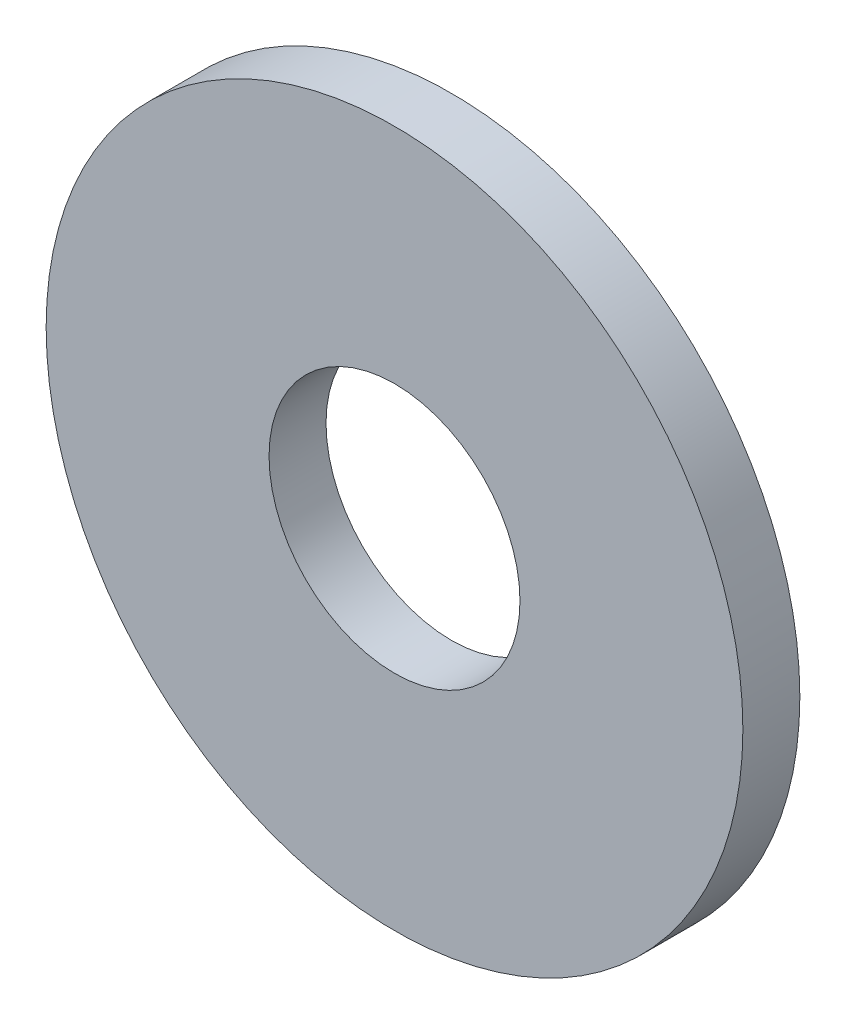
ISO-10303-21;
HEADER;
FILE_DESCRIPTION(('STEP AP214'),'2;1');
FILE_NAME('part.step','',(''),(''),'','','');
FILE_SCHEMA(('AUTOMOTIVE_DESIGN { 1 0 10303 214 1 1 1 1 }'));
ENDSEC;
DATA;
#1=APPLICATION_CONTEXT('core data for automotive mechanical design processes');
#2=APPLICATION_PROTOCOL_DEFINITION('international standard','automotive_design',2000,#1);
#3=PRODUCT_CONTEXT('',#1,'mechanical');
#4=PRODUCT('Part','Part','',(#3));
#5=PRODUCT_RELATED_PRODUCT_CATEGORY('part','',(#4));
#6=PRODUCT_DEFINITION_FORMATION('','',#4);
#7=PRODUCT_DEFINITION_CONTEXT('part definition',#1,'design');
#8=PRODUCT_DEFINITION('design','',#6,#7);
#9=PRODUCT_DEFINITION_SHAPE('','',#8);
#10=(LENGTH_UNIT() NAMED_UNIT(*) SI_UNIT(.MILLI.,.METRE.));
#11=(NAMED_UNIT(*) PLANE_ANGLE_UNIT() SI_UNIT($,.RADIAN.));
#12=(NAMED_UNIT(*) SI_UNIT($,.STERADIAN.) SOLID_ANGLE_UNIT());
#13=UNCERTAINTY_MEASURE_WITH_UNIT(LENGTH_MEASURE(1.E-05),#10,'distance_accuracy_value','');
#14=(GEOMETRIC_REPRESENTATION_CONTEXT(3) GLOBAL_UNCERTAINTY_ASSIGNED_CONTEXT((#13)) GLOBAL_UNIT_ASSIGNED_CONTEXT((#10,
#11,#12)) REPRESENTATION_CONTEXT('',''));
#15=CARTESIAN_POINT('',(0.,0.,0.));
#16=DIRECTION('',(0.,0.,1.));
#17=DIRECTION('',(1.,0.,0.));
#18=AXIS2_PLACEMENT_3D('',#15,#16,#17);
#19=CARTESIAN_POINT('',(0.,0.,1.93));
#20=DIRECTION('',(0.,0.,1.));
#21=DIRECTION('',(1.,0.,0.));
#22=AXIS2_PLACEMENT_3D('',#19,#20,#21);
#23=PLANE('',#22);
#24=CARTESIAN_POINT('',(0.,0.,1.93));
#25=DIRECTION('',(0.,0.,1.));
#26=DIRECTION('',(1.,0.,0.));
#27=AXIS2_PLACEMENT_3D('',#24,#25,#26);
#28=CIRCLE('',#27,11.8);
#29=CARTESIAN_POINT('',(11.8,0.,1.93));
#30=VERTEX_POINT('',#29);
#31=EDGE_CURVE('E10',#30,#30,#28,.T.);
#32=ORIENTED_EDGE('',*,*,#31,.T.);
#33=EDGE_LOOP('',(#32));
#34=FACE_BOUND('',#33,.T.);
#35=CARTESIAN_POINT('',(0.,0.,1.93));
#36=DIRECTION('',(0.,0.,1.));
#37=DIRECTION('',(1.,0.,0.));
#38=AXIS2_PLACEMENT_3D('',#35,#36,#37);
#39=CIRCLE('',#38,4.25);
#40=CARTESIAN_POINT('',(4.25,0.,1.93));
#41=VERTEX_POINT('',#40);
#42=EDGE_CURVE('E45',#41,#41,#39,.T.);
#43=ORIENTED_EDGE('',*,*,#42,.F.);
#44=EDGE_LOOP('',(#43));
#45=FACE_BOUND('',#44,.T.);
#46=ADVANCED_FACE('F34',(#34,#45),#23,.T.);
#47=CARTESIAN_POINT('',(0.,0.,0.));
#48=DIRECTION('',(0.,0.,1.));
#49=DIRECTION('',(1.,0.,0.));
#50=AXIS2_PLACEMENT_3D('',#47,#48,#49);
#51=PLANE('',#50);
#52=CARTESIAN_POINT('',(0.,0.,0.));
#53=DIRECTION('',(0.,0.,1.));
#54=DIRECTION('',(1.,0.,0.));
#55=AXIS2_PLACEMENT_3D('',#52,#53,#54);
#56=CIRCLE('',#55,11.8);
#57=CARTESIAN_POINT('',(11.8,0.,0.));
#58=VERTEX_POINT('',#57);
#59=EDGE_CURVE('E38',#58,#58,#56,.T.);
#60=ORIENTED_EDGE('',*,*,#59,.F.);
#61=EDGE_LOOP('',(#60));
#62=FACE_BOUND('',#61,.T.);
#63=CARTESIAN_POINT('',(0.,0.,0.));
#64=DIRECTION('',(0.,0.,1.));
#65=DIRECTION('',(1.,0.,0.));
#66=AXIS2_PLACEMENT_3D('',#63,#64,#65);
#67=CIRCLE('',#66,4.25);
#68=CARTESIAN_POINT('',(4.25,0.,0.));
#69=VERTEX_POINT('',#68);
#70=EDGE_CURVE('E47',#69,#69,#67,.T.);
#71=ORIENTED_EDGE('',*,*,#70,.T.);
#72=EDGE_LOOP('',(#71));
#73=FACE_BOUND('',#72,.T.);
#74=ADVANCED_FACE('F57',(#62,#73),#51,.F.);
#75=CARTESIAN_POINT('',(0.,0.,1.93));
#76=DIRECTION('',(0.,0.,-1.));
#77=DIRECTION('',(-1.,0.,0.));
#78=AXIS2_PLACEMENT_3D('',#75,#76,#77);
#79=CYLINDRICAL_SURFACE('',#78,11.8);
#80=ORIENTED_EDGE('',*,*,#31,.F.);
#81=EDGE_LOOP('',(#80));
#82=FACE_BOUND('',#81,.T.);
#83=ORIENTED_EDGE('',*,*,#59,.T.);
#84=EDGE_LOOP('',(#83));
#85=FACE_BOUND('',#84,.T.);
#86=ADVANCED_FACE('F36',(#82,#85),#79,.T.);
#87=CARTESIAN_POINT('',(0.,0.,1.93));
#88=DIRECTION('',(0.,0.,-1.));
#89=DIRECTION('',(-1.,0.,0.));
#90=AXIS2_PLACEMENT_3D('',#87,#88,#89);
#91=CYLINDRICAL_SURFACE('',#90,4.25);
#92=ORIENTED_EDGE('',*,*,#42,.T.);
#93=EDGE_LOOP('',(#92));
#94=FACE_BOUND('',#93,.T.);
#95=ORIENTED_EDGE('',*,*,#70,.F.);
#96=EDGE_LOOP('',(#95));
#97=FACE_BOUND('',#96,.T.);
#98=ADVANCED_FACE('F53',(#94,#97),#91,.F.);
#99=CLOSED_SHELL('',(#46,#74,#86,#98));
#100=MANIFOLD_SOLID_BREP('B2',#99);
#101=ADVANCED_BREP_SHAPE_REPRESENTATION('',(#18,#100),#14);
#102=SHAPE_DEFINITION_REPRESENTATION(#9,#101);
ENDSEC;
END-ISO-10303-21;
